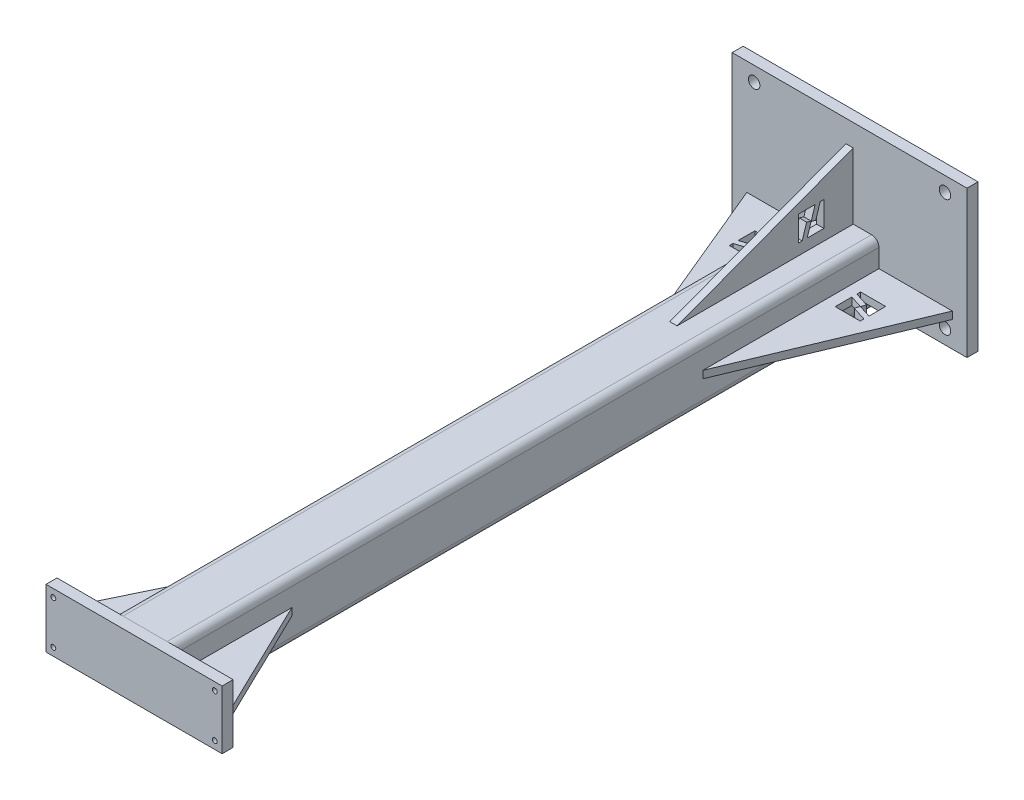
from build123d import *

# Parameters (mm, degrees)
TUBE_SQUARE_TS4X4X0_25_4_DEPTH    = 1219.2
SKETCH12_W                        = 406.4
SKETCH12_H                        = 254
BOSS_EXTRUDE1_DEPTH               = 19.05
SKETCH14_W                        = 9.92124
SKETCH14_H                        = 19.05
F_3_4_CLEARANCE_HOLE1_AT_2_COUNT  = 2
F_3_4_CLEARANCE_HOLE1_AT_2_PITCH  = 203.2
F_3_4_CLEARANCE_HOLE1_AT_3_COUNT  = 2
F_3_4_CLEARANCE_HOLE1_AT_3_PITCH  = 387.714173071
F_3_4_CLEARANCE_HOLE1_AT_4_COUNT  = 2
F_3_4_CLEARANCE_HOLE1_AT_4_PITCH  = 330.2
GUSSET1_THICKNESS                 = 12.7
CUT_EXTRUDE1_DEPTH                = 1271.158740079
GUSSET2_THICKNESS                 = 12.7
CUT_EXTRUDE2_DEPTH                = 1273.188863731
SKETCH136_W                       = 304.8
SKETCH136_H                       = 101.6
BOSS_EXTRUDE2_DEPTH               = 19.05
SKETCH138_W                       = 4.2164
SKETCH138_H                       = 19.05
F_5_16_CLEARANCE_HOLE1_AT_2_COUNT = 2
F_5_16_CLEARANCE_HOLE1_AT_2_PITCH = 74.6252
MIRROR4_COPY_1_SKETCH_W           = 4.2164
MIRROR4_COPY_1_SKETCH_H           = 19.05
BOSS_EXTRUDE3_DEPTH               = 6.35


with BuildPart() as part:
    # Sketch1 → Tube _square_ TS4X4X0.25_4 (new body)
    with BuildSketch(Plane(origin=(0, 0, 0), x_dir=(1, 0, 0), z_dir=(0, 0, -1))):
        with BuildLine():
            Line((-38.1, -50.8), (38.1, -50.8))
            ThreePointArc((38.1, -50.8), (47.080256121, -47.080256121), (50.8, -38.1))
            Line((50.8, -38.1), (50.8, 38.1))
            ThreePointArc((50.8, 38.1), (47.080256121, 47.080256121), (38.1, 50.8))
            Line((38.1, 50.8), (-38.1, 50.8))
            ThreePointArc((-38.1, 50.8), (-47.080256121, 47.080256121), (-50.8, 38.1))
            Line((-50.8, 38.1), (-50.8, -38.1))
            ThreePointArc((-50.8, -38.1), (-47.080256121, -47.080256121), (-38.1, -50.8))
        make_face()
        with BuildLine():
            Line((-38.1, -44.45), (38.1, -44.45))
            ThreePointArc((38.1, -44.45), (42.590128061, -42.590128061), (44.45, -38.1))
            Line((44.45, -38.1), (44.45, 38.1))
            ThreePointArc((44.45, 38.1), (42.590128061, 42.590128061), (38.1, 44.45))
            Line((38.1, 44.45), (-38.1, 44.45))
            ThreePointArc((-38.1, 44.45), (-42.590128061, 42.590128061), (-44.45, 38.1))
            Line((-44.45, 38.1), (-44.45, -38.1))
            ThreePointArc((-44.45, -38.1), (-42.590128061, -42.590128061), (-38.1, -44.45))
        make_face(mode=Mode.SUBTRACT)
    extrude(amount=TUBE_SQUARE_TS4X4X0_25_4_DEPTH)


with BuildPart() as body_2:
    # Sketch12 → Boss-Extrude1 (new body)
    with BuildSketch(Plane(origin=(0, 0, -1219.2), x_dir=(-1, 0, 0), z_dir=(0, 0, -1))):
        with Locations((0, 76.2)):
            Rectangle(SKETCH12_W, SKETCH12_H)
    extrude(amount=BOSS_EXTRUDE1_DEPTH)

    # Sketch14 → 3_4 Clearance Hole1 (revolve, cut)
    with BuildSketch(Plane(origin=(-165.1, 177.8, -1219.2), x_dir=(0, -1, 0), z_dir=(1, 0, 0))):
        with Locations((4.96062, 9.525)):
            Rectangle(SKETCH14_W, SKETCH14_H)
    f_3_4_clearance_hole1 = revolve(axis=Axis((-165.1, 177.8, -1212.85), (0, 0, -1)), mode=Mode.SUBTRACT)

    # 3_4 Clearance Hole1 at 2: 3_4 Clearance Hole1 ×2
    with Locations(*[(0, -i * F_3_4_CLEARANCE_HOLE1_AT_2_PITCH, 0) for i in range(1, F_3_4_CLEARANCE_HOLE1_AT_2_COUNT)]):
        add(f_3_4_clearance_hole1, mode=Mode.SUBTRACT)

    # 3_4 Clearance Hole1 at 3: 3_4 Clearance Hole1 ×2
    with Locations(*[Vector(0.8516583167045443, -0.524097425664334, 0) * (i * F_3_4_CLEARANCE_HOLE1_AT_3_PITCH) for i in range(1, F_3_4_CLEARANCE_HOLE1_AT_3_COUNT)]):
        add(f_3_4_clearance_hole1, mode=Mode.SUBTRACT)

    # 3_4 Clearance Hole1 at 4: 3_4 Clearance Hole1 ×2
    with Locations(*[(i * F_3_4_CLEARANCE_HOLE1_AT_4_PITCH, 0, 0) for i in range(1, F_3_4_CLEARANCE_HOLE1_AT_4_COUNT)]):
        add(f_3_4_clearance_hole1, mode=Mode.SUBTRACT)


with BuildPart() as body_3:
    # Gusset1: a gusset: a plate 12.7 thick in the corner of two members, its outline drawn in place
    gusset1_outline = Wire([Line((-50.8, -6.35, -1219.2), (-50.8, -6.35, -914.4)), Line((-50.8, -6.35, -914.4), (-177.8, -6.35, -1219.2)), Line((-177.8, -6.35, -1219.2), (-50.8, -6.35, -1219.2))])
    add(extrude(Face(gusset1_outline), amount=GUSSET1_THICKNESS, dir=(0, 1, 0)))

    # Sketch134 → Cut-Extrude1 (cut, through all)
    with BuildSketch(Plane(origin=(0, 6.35, 0), x_dir=(1, 0, 0), z_dir=(0, 1, 0))):
        Polygon((-91.347573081, 1146.468897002), (-88.928790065, 1138.493181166), (-113.250509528, 1130.821952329), (-113.250509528, 1124.428096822), (-69.85, 1124.428096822), (-69.85, 1153.301471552), align=None)
        Polygon((-91.773251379, 1146.327968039), (-94.181876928, 1154.303683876), (-69.85, 1161.974912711), (-69.85, 1168.4), (-113.238779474, 1168.4), (-113.314599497, 1139.511009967), align=None)
    extrude(amount=-CUT_EXTRUDE1_DEPTH, mode=Mode.SUBTRACT)


with BuildPart() as body_4:
    # Gusset2: a gusset: a plate 12.7 thick in the corner of two members, its outline drawn in place
    gusset2_outline = Wire([Line((-6.35, 50.8, -1219.2), (-6.35, 50.8, -914.4)), Line((-6.35, 50.8, -914.4), (-6.35, 165.1, -1219.2)), Line((-6.35, 165.1, -1219.2), (-6.35, 50.8, -1219.2))])
    add(extrude(Face(gusset2_outline), amount=GUSSET2_THICKNESS, dir=(1, 0, 0)))

    # Sketch135 → Cut-Extrude2 (cut, through all)
    with BuildSketch(Plane.ZY.offset(6.35)):
        Polygon((-1146.35919982, 91.347573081), (-1154.334915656, 88.928790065), (-1162.006144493, 113.250509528), (-1168.4, 113.250509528), (-1168.4, 69.85), (-1139.52662527, 69.85), align=None)
        Polygon((-1146.500128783, 91.773251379), (-1138.524412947, 94.181876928), (-1130.853184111, 69.85), (-1124.428096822, 69.85), (-1124.428096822, 113.238779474), (-1153.317086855, 113.314599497), align=None)
    extrude(amount=-CUT_EXTRUDE2_DEPTH, mode=Mode.SUBTRACT)


with BuildPart() as body_5:
    # Mirror3: mirrored copy
    add(body_3.part.mirror(Plane.ZY))


with BuildPart() as body_6:
    # Sketch136 → Boss-Extrude2 (new body)
    with BuildSketch(Plane.XY):
        Rectangle(SKETCH136_W, SKETCH136_H)
    extrude(amount=BOSS_EXTRUDE2_DEPTH)

    # Sketch138 → 5_16 Clearance Hole1 (revolve, cut)
    with BuildSketch(Plane(origin=(-139.7, 37.3126, 0), x_dir=(0, 1, 0), z_dir=(1, 0, 0))):
        with Locations((2.1082, 9.525)):
            Rectangle(SKETCH138_W, SKETCH138_H)
    f_5_16_clearance_hole1 = revolve(axis=Axis((-139.7, 37.3126, -6.35), (0, 0, 1)), mode=Mode.SUBTRACT)

    # 5_16 Clearance Hole1 at 2: 5_16 Clearance Hole1 ×2
    with Locations(*[(0, -i * F_5_16_CLEARANCE_HOLE1_AT_2_PITCH, 0) for i in range(1, F_5_16_CLEARANCE_HOLE1_AT_2_COUNT)]):
        add(f_5_16_clearance_hole1, mode=Mode.SUBTRACT)

    # Mirror4: 5_16 Clearance Hole1 across plane
    add(f_5_16_clearance_hole1.mirror(Plane.ZY), mode=Mode.SUBTRACT)

    # Mirror4 copy 1 sketch → Mirror4 copy 1 (revolve, cut)
    with BuildSketch(Plane(origin=(139.7, -37.3126, 0), x_dir=(0, 1, 0), z_dir=(-1, 0, 0))):
        with Locations((2.1082, -9.525)):
            Rectangle(MIRROR4_COPY_1_SKETCH_W, MIRROR4_COPY_1_SKETCH_H)
    revolve(axis=Axis((139.7, -37.3126, -6.35), (0, 0, -1)), mode=Mode.SUBTRACT)


with BuildPart() as body_7:
    # Sketch139 → Boss-Extrude3 (new, symmetric)
    with BuildSketch(Plane(origin=(0, 0, 0), x_dir=(1, 0, 0), z_dir=(0, 1, 0))):
        Polygon((149.225, 0), (50.8, 203.2), (50.8, 0), align=None)
    extrude(amount=BOSS_EXTRUDE3_DEPTH, both=True)


with BuildPart() as body_8:
    # Mirror5: mirrored copy
    add(body_7.part.mirror(Plane.ZY))


solid = Compound([part.part, body_2.part, body_3.part, body_4.part, body_5.part, body_6.part, body_7.part, body_8.part])
